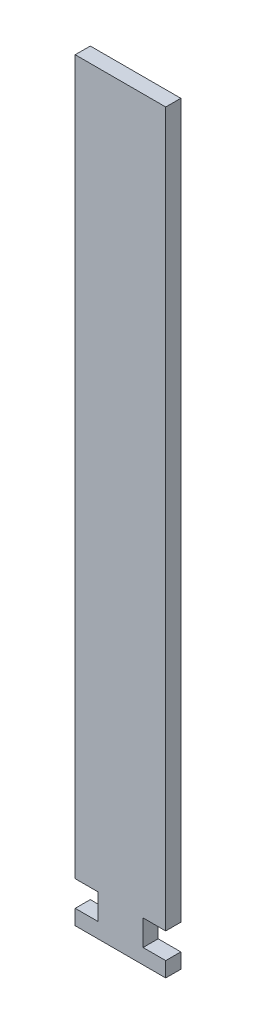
from build123d import *

# Parameters (mm, degrees)
SKIZZE1_W                       = 60
SKIZZE1_H                       = 500
AUFSATZ_LINEAR_AUSTRAGEN1_DEPTH = 10
SKIZZE2_W                       = 15
SKIZZE2_H                       = 17
SCHNITT_LINEAR_AUSTRAGEN1_DEPTH = 10


with BuildPart() as part:
    # Skizze1 → Aufsatz-Linear austragen1 (new body)
    with BuildSketch(Plane.XY):
        with Locations((-49.841497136, 200.301204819)):
            Rectangle(SKIZZE1_W, SKIZZE1_H)
    extrude(amount=AUFSATZ_LINEAR_AUSTRAGEN1_DEPTH)

    # Skizze2 → Schnitt-Linear austragen1 (cut)
    with BuildSketch(Plane.XY.offset(10)):
        with Locations((-27.341497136, -31.198795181)):
            Rectangle(SKIZZE2_W, SKIZZE2_H)
        with Locations((-72.341497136, -31.198795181)):
            Rectangle(SKIZZE2_W, SKIZZE2_H)
    extrude(amount=-SCHNITT_LINEAR_AUSTRAGEN1_DEPTH, mode=Mode.SUBTRACT)


solid = part.part
